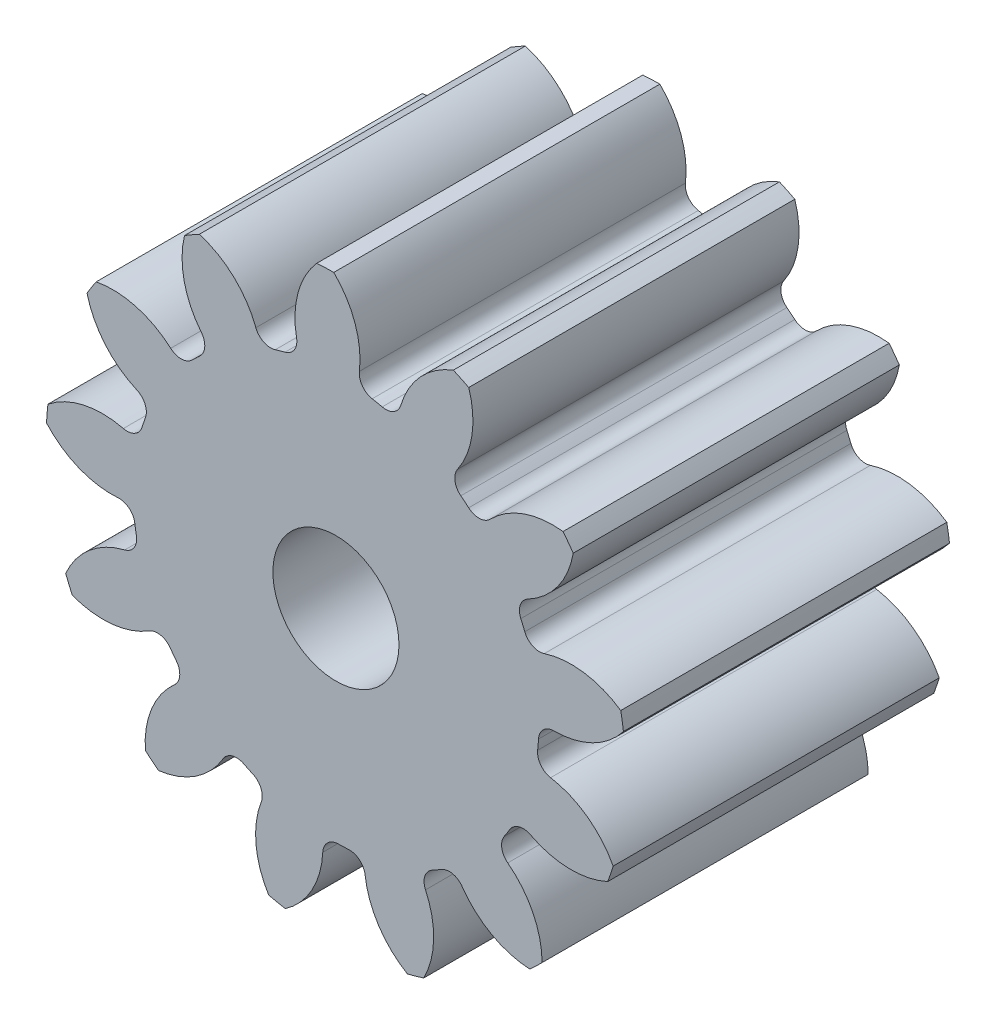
from build123d import *

# Parameters (mm, degrees)
SKETCH3_R         = 84.666666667
GEARBODY_DEPTH    = 95.25
TOOTHCUT_DEPTH    = 154.00147512
CIRPATTERN1_COUNT = 13
BOREDIA_R         = 18.415
BORE_DEPTH        = 12700


with BuildPart() as part:
    # Sketch3 → gearBody (new body)
    with BuildSketch(Plane.XY):
        Circle(SKETCH3_R)
    extrude(amount=GEARBODY_DEPTH)

    # Sketch2 → toothCut (cut, through all)
    with BuildSketch(Plane.XY):
        with BuildLine():
            ThreePointArc((58.914151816, -6.45449406), (59.057701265, -4.972494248), (59.163976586, -3.487356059))
            ThreePointArc((59.163976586, -3.487356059), (60.596178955, -0.417078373), (63.743469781, 0.83686307))
            ThreePointArc((63.743469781, 0.83686307), (75.544978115, 3.746353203), (84.666666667, 11.779754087))
            ThreePointArc((84.666666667, 11.779754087), (85.180805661, -7.171987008), (81.505002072, -25.770946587))
            ThreePointArc((81.505002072, -25.770946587), (73.854991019, -16.325415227), (62.7061238, -11.483567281))
            ThreePointArc((62.7061238, -11.483567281), (59.812812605, -9.721023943), (58.914151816, -6.45449406))
        make_face()
    toothcut = extrude(amount=TOOTHCUT_DEPTH, mode=Mode.SUBTRACT)

    # CirPattern1: toothCut ×13 about axis
    cirpattern1_axis = Axis((0, 0, 0), (0, 0, 1))
    for i in range(1, CIRPATTERN1_COUNT):
        add(toothcut.rotate(cirpattern1_axis, i * 360 / CIRPATTERN1_COUNT), mode=Mode.SUBTRACT)

    # boreDia → bore (cut, symmetric)
    with BuildSketch(Plane.XY):
        Circle(BOREDIA_R)
    extrude(amount=BORE_DEPTH, both=True, mode=Mode.SUBTRACT)


solid = part.part
